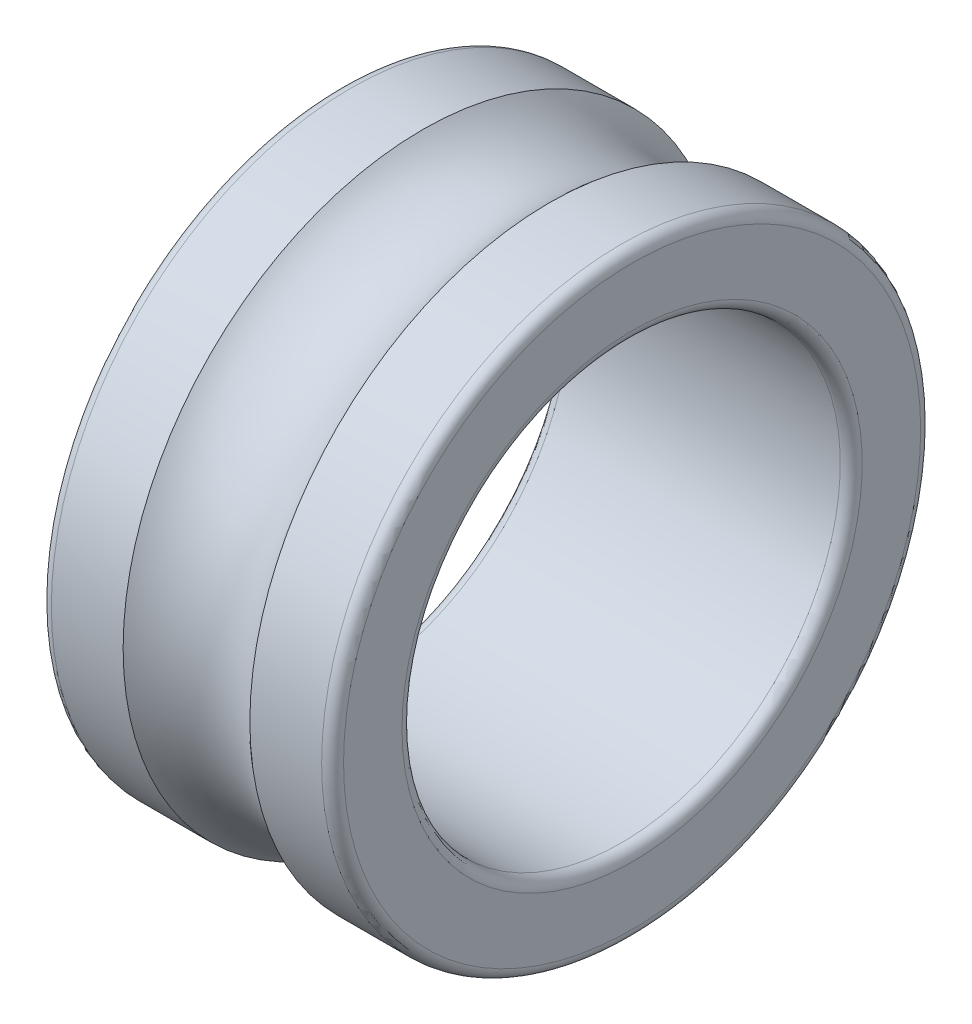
from build123d import *


with BuildPart() as part:
    # Esquisse1 → Base-R_volution (revolve)
    with BuildSketch(Plane.XY, mode=Mode.PRIVATE) as base_r_volution_sk:
        with BuildLine():
            Line((0, 6.3), (0, 7.9))
            ThreePointArc((0, 7.9), (-0.087867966, 8.112132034), (-0.3, 8.2))
            Line((-0.3, 8.2), (-2.265064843, 8.2))
            ThreePointArc((-2.265064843, 8.2), (-4, 7.5), (-5.734935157, 8.2))
            Line((-5.734935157, 8.2), (-7.7, 8.2))
            ThreePointArc((-7.7, 8.2), (-7.912132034, 8.112132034), (-8, 7.9))
            Line((-8, 7.9), (-8, 6.3))
            ThreePointArc((-8, 6.3), (-7.912132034, 6.087867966), (-7.7, 6))
            Line((-7.7, 6), (-0.3, 6))
            ThreePointArc((-0.3, 6), (-0.087867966, 6.087867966), (0, 6.3))
        make_face()
    revolve(base_r_volution_sk.sketch.rotate(Axis((-60, 0, 0), (1, 0, 0)), 90), axis=Axis((-60, 0, 0), (1, 0, 0)))


solid = part.part
